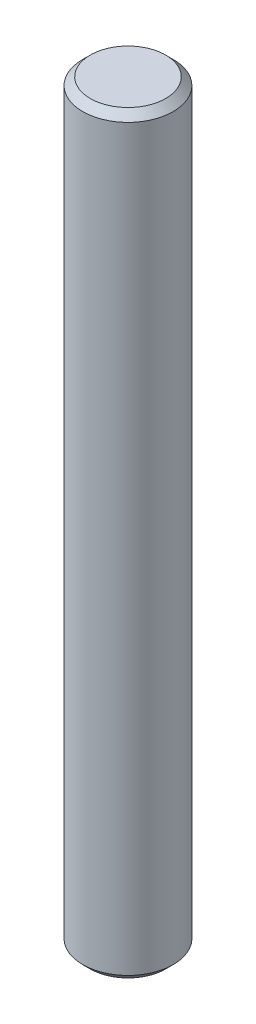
from build123d import *

# Parameters (mm, degrees)
SKETCH1_R           = 1.5
BOSS_EXTRUDE1_DEPTH = 25
CHAMFER1_SIZE       = 0.25


with BuildPart() as part:
    # Sketch1 → Boss-Extrude1 (new body)
    with BuildSketch(Plane(origin=(0, 0, 0), x_dir=(1, 0, 0), z_dir=(0, 1, 0))):
        with Locations(Location((0, 0, 0), (0, 0, 270))):
            Circle(SKETCH1_R)
    extrude(amount=BOSS_EXTRUDE1_DEPTH)

    # Chamfer1
    chamfer1_edges = [part.edges().sort_by_distance(p)[0] for p in [
        (0, 0, -1.5),
        (0, 25, -1.5),
    ]]
    chamfer(chamfer1_edges, length=CHAMFER1_SIZE)


solid = part.part
